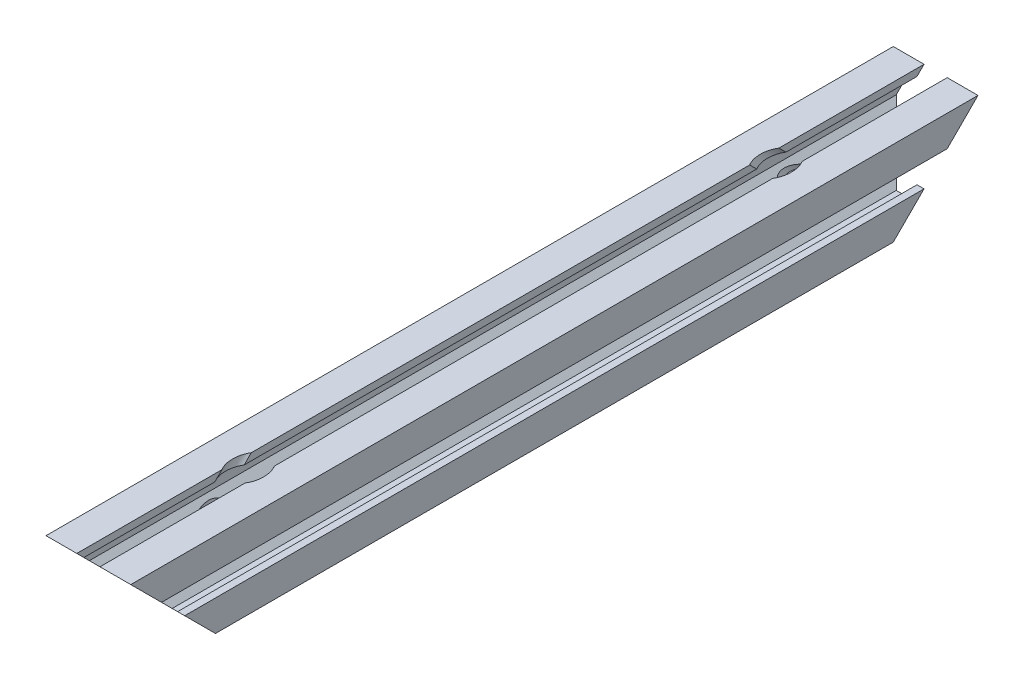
from build123d import *

# Parameters (mm, degrees)
EXTRUDE1_DEPTH      = 150
EXTRUDE1_DEPTH_BACK = 150
EXTRUDE2_DEPTH      = 150
SKETCH3_R           = 3.175
EXTRUDE3_DEPTH      = 234.104060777
SKETCH4_R           = 5.5
SKETCH4_R_2         = 3.175
EXTRUDE4_DEPTH      = 150


with BuildPart() as part:
    # Sketch1 → Extrude1 (new, two sides: drawn at the far end of the back side and taken through both)
    with BuildSketch(Plane.XY.offset(-EXTRUDE1_DEPTH_BACK)):
        Polygon((5.032148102, -3.971490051), (5.032148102, 3.971490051), (7.86063987, 6.79998182), (12.499974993, 6.79998182), (12.499974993, 4.099990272), (14.999969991, 4.099990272), (14.999969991, 14.999969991), (4.099990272, 14.999969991), (4.099990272, 12.499974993), (6.79998182, 12.499974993), (6.79998182, 7.86063987), (3.971490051, 5.032148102), (-3.971490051, 5.032148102), (-6.79998182, 7.86063987), (-6.79998182, 12.499974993), (-4.099990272, 12.499974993), (-4.099990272, 14.999969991), (-14.999969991, 14.999969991), (-14.999969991, 4.099990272), (-12.499974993, 4.099990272), (-12.499974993, 6.79998182), (-7.86063987, 6.79998182), (-5.032148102, 3.971490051), (-5.032148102, -3.971490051), (-7.86063987, -6.79998182), (-12.499974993, -6.79998182), (-12.499974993, -4.099990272), (-14.999969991, -4.099990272), (-14.999969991, -14.999969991), (-4.099990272, -14.999969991), (-4.099990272, -12.499974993), (-6.79998182, -12.499974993), (-6.79998182, -7.86063987), (-3.971490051, -5.032148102), (3.971490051, -5.032148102), (6.79998182, -7.86063987), (6.79998182, -12.499974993), (4.099990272, -12.499974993), (4.099990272, -14.999969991), (14.999969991, -14.999969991), (14.999969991, -4.099990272), (12.499974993, -4.099990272), (12.499974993, -6.79998182), (7.86063987, -6.79998182), align=None)
        with BuildLine():
            Line((-9.29997682, 7.79997982), (-13.499972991, 7.79997982))
            ThreePointArc((-13.499972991, 7.79997982), (-13.853525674, 7.946426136), (-13.999971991, 8.29997882))
            Line((-13.999971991, 8.29997882), (-13.999971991, 12.499974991))
            ThreePointArc((-13.999971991, 12.499974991), (-13.560633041, 13.560633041), (-12.499974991, 13.999971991))
            Line((-12.499974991, 13.999971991), (-8.29997882, 13.999971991))
            ThreePointArc((-8.29997882, 13.999971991), (-7.946426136, 13.853525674), (-7.79997982, 13.499972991))
            Line((-7.79997982, 13.499972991), (-7.79997982, 9.29997682))
            ThreePointArc((-7.79997982, 9.29997682), (-8.239318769, 8.239318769), (-9.29997682, 7.79997982))
        make_face(mode=Mode.SUBTRACT)
        with BuildLine():
            Line((13.499972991, 7.79997982), (9.29997682, 7.79997982))
            ThreePointArc((9.29997682, 7.79997982), (8.239318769, 8.239318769), (7.79997982, 9.29997682))
            Line((7.79997982, 9.29997682), (7.79997982, 13.499972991))
            ThreePointArc((7.79997982, 13.499972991), (7.946426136, 13.853525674), (8.29997882, 13.999971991))
            Line((8.29997882, 13.999971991), (12.499974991, 13.999971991))
            ThreePointArc((12.499974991, 13.999971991), (13.560633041, 13.560633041), (13.999971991, 12.499974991))
            Line((13.999971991, 12.499974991), (13.999971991, 8.29997882))
            ThreePointArc((13.999971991, 8.29997882), (13.853525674, 7.946426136), (13.499972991, 7.79997982))
        make_face(mode=Mode.SUBTRACT)
        with BuildLine():
            Line((12.499974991, -13.999971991), (8.29997882, -13.999971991))
            ThreePointArc((8.29997882, -13.999971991), (7.946426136, -13.853525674), (7.79997982, -13.499972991))
            Line((7.79997982, -13.499972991), (7.79997982, -9.29997682))
            ThreePointArc((7.79997982, -9.29997682), (8.239318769, -8.239318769), (9.29997682, -7.79997982))
            Line((9.29997682, -7.79997982), (13.499972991, -7.79997982))
            ThreePointArc((13.499972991, -7.79997982), (13.853525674, -7.946426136), (13.999971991, -8.29997882))
            Line((13.999971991, -8.29997882), (13.999971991, -12.499974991))
            ThreePointArc((13.999971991, -12.499974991), (13.560633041, -13.560633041), (12.499974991, -13.999971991))
        make_face(mode=Mode.SUBTRACT)
        with BuildLine():
            Line((-8.29997882, -13.999971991), (-12.499974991, -13.999971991))
            ThreePointArc((-12.499974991, -13.999971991), (-13.560633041, -13.560633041), (-13.999971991, -12.499974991))
            Line((-13.999971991, -12.499974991), (-13.999971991, -8.29997882))
            ThreePointArc((-13.999971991, -8.29997882), (-13.853525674, -7.946426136), (-13.499972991, -7.79997982))
            Line((-13.499972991, -7.79997982), (-9.29997682, -7.79997982))
            ThreePointArc((-9.29997682, -7.79997982), (-8.239318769, -8.239318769), (-7.79997982, -9.29997682))
            Line((-7.79997982, -9.29997682), (-7.79997982, -13.499972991))
            ThreePointArc((-7.79997982, -13.499972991), (-7.946426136, -13.853525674), (-8.29997882, -13.999971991))
        make_face(mode=Mode.SUBTRACT)
        with BuildLine():
            Line((-3.262731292, 1.848520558), (-3.657279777, 2.243069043))
            Line((-3.657279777, 2.243069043), (-3.87887909, 3.285870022))
            ThreePointArc((-3.87887909, 3.285870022), (-3.743353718, 3.743353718), (-3.285870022, 3.87887909))
            Line((-3.285870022, 3.87887909), (-2.243069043, 3.657279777))
            Line((-2.243069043, 3.657279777), (-1.848520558, 3.262731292))
            ThreePointArc((-1.848520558, 3.262731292), (0, 3.749992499), (1.848520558, 3.262731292))
            Line((1.848520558, 3.262731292), (2.243069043, 3.657279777))
            Line((2.243069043, 3.657279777), (3.285870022, 3.87887909))
            ThreePointArc((3.285870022, 3.87887909), (3.743353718, 3.743353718), (3.87887909, 3.285870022))
            Line((3.87887909, 3.285870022), (3.657279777, 2.243069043))
            Line((3.657279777, 2.243069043), (3.262731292, 1.848520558))
            ThreePointArc((3.262731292, 1.848520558), (3.749992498, 0), (3.262731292, -1.848520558))
            Line((3.262731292, -1.848520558), (3.657279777, -2.243069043))
            Line((3.657279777, -2.243069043), (3.87887909, -3.285870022))
            ThreePointArc((3.87887909, -3.285870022), (3.743353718, -3.743353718), (3.285870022, -3.87887909))
            Line((3.285870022, -3.87887909), (2.243069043, -3.657279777))
            Line((2.243069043, -3.657279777), (1.848520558, -3.262731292))
            ThreePointArc((1.848520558, -3.262731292), (0, -3.749992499), (-1.848520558, -3.262731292))
            Line((-1.848520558, -3.262731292), (-2.243069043, -3.657279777))
            Line((-2.243069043, -3.657279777), (-3.285870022, -3.87887909))
            ThreePointArc((-3.285870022, -3.87887909), (-3.743353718, -3.743353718), (-3.87887909, -3.285870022))
            Line((-3.87887909, -3.285870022), (-3.657279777, -2.243069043))
            Line((-3.657279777, -2.243069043), (-3.262731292, -1.848520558))
            ThreePointArc((-3.262731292, -1.848520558), (-3.749992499, 0), (-3.262731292, 1.848520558))
        make_face(mode=Mode.SUBTRACT)
    extrude(amount=EXTRUDE1_DEPTH + EXTRUDE1_DEPTH_BACK)

    # Sketch2 → Extrude2 (cut)
    with BuildSketch(Plane(origin=(14.999969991, 0, 0), x_dir=(0, 0, -1), z_dir=(1, 0, 0))):
        Polygon((-150, -14.999969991), (-120.000060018, -14.999969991), (-139.100020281, 4.099990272), (-150, 4.099990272), align=None)
        Polygon((-150, 4.099990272), (-139.100020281, 4.099990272), (-150, 14.999969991), align=None)
    extrude2 = extrude(amount=-EXTRUDE2_DEPTH, mode=Mode.SUBTRACT)

    # Sketch3 → Extrude3 (cut, through all)
    with BuildSketch(Plane(origin=(0, -67.500015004, 67.500015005), x_dir=(1, 0, 0), z_dir=(0, -0.7071067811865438, 0.7071067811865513))):
        with Locations(Location((3.0009e-05, 76.672597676, 0), (0, 0, 305.605551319))):
            Circle(SKETCH3_R)
    extrude3 = extrude(amount=-EXTRUDE3_DEPTH, mode=Mode.SUBTRACT)

    # Sketch4 → Extrude4 (cut)
    with BuildSketch(Plane(origin=(0, -52.6507726, 52.6507726), x_dir=(1, 0, 0), z_dir=(0, -0.7071067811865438, 0.7071067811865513))):
        with Locations((3.0009e-05, 76.672597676)):
            Circle(SKETCH4_R)
        with Locations(Location((3.0009e-05, 76.672597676, 0), (0, 0, 305.605551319))):
            Circle(SKETCH4_R_2, mode=Mode.SUBTRACT)
    extrude4 = extrude(amount=-EXTRUDE4_DEPTH, mode=Mode.SUBTRACT)

    # Mirror1: Extrude2, Extrude3, Extrude4 across plane
    add(extrude2.mirror(Plane.XY), mode=Mode.SUBTRACT)
    add(extrude3.mirror(Plane.XY), mode=Mode.SUBTRACT)
    add(extrude4.mirror(Plane.XY), mode=Mode.SUBTRACT)


solid = part.part
